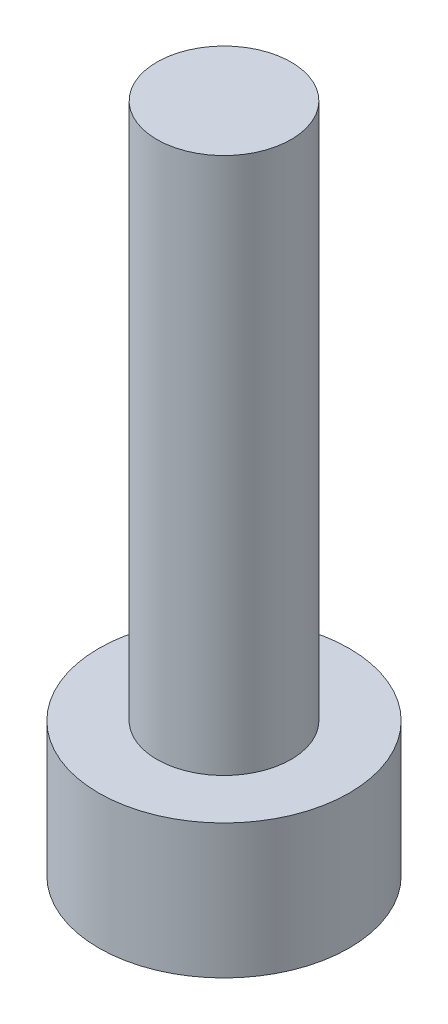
from build123d import *

# Parameters (mm, degrees)
SKETCH_1_R          = 2.8
EXTRUDE_1_DEPTH     = 3
SKETCH_2_R          = 1.5
EXTRUDE_2_DEPTH     = 12
CUT_EXTRUDE_1_DEPTH = 1.5


with BuildPart() as part:
    # Sketch 1 → Extrude 1 (new body)
    with BuildSketch(Plane(origin=(0, 0, 0), x_dir=(1, 0, 0), z_dir=(0, 1, 0))):
        with Locations(Location((0, 0, 0), (0, 0, 270))):
            Circle(SKETCH_1_R)
    extrude(amount=EXTRUDE_1_DEPTH)

    # Sketch 2 → Extrude 2 (add)
    with BuildSketch(Plane(origin=(0, 3, 0), x_dir=(1, 0, 0), z_dir=(0, 1, 0))):
        with Locations(Location((0, 0, 0), (0, 0, 270))):
            Circle(SKETCH_2_R)
    extrude(amount=EXTRUDE_2_DEPTH)

    # Sketch 3 → Cut-Extrude 1 (cut)
    with BuildSketch(Plane.XZ):
        Polygon((1.084583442, -0.952371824), (1.367069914, 0.463090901), (0.282486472, 1.415462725), (-1.084583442, 0.952371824), (-1.367069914, -0.463090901), (-0.282486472, -1.415462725), align=None)
    extrude(amount=-CUT_EXTRUDE_1_DEPTH, mode=Mode.SUBTRACT)


solid = part.part
